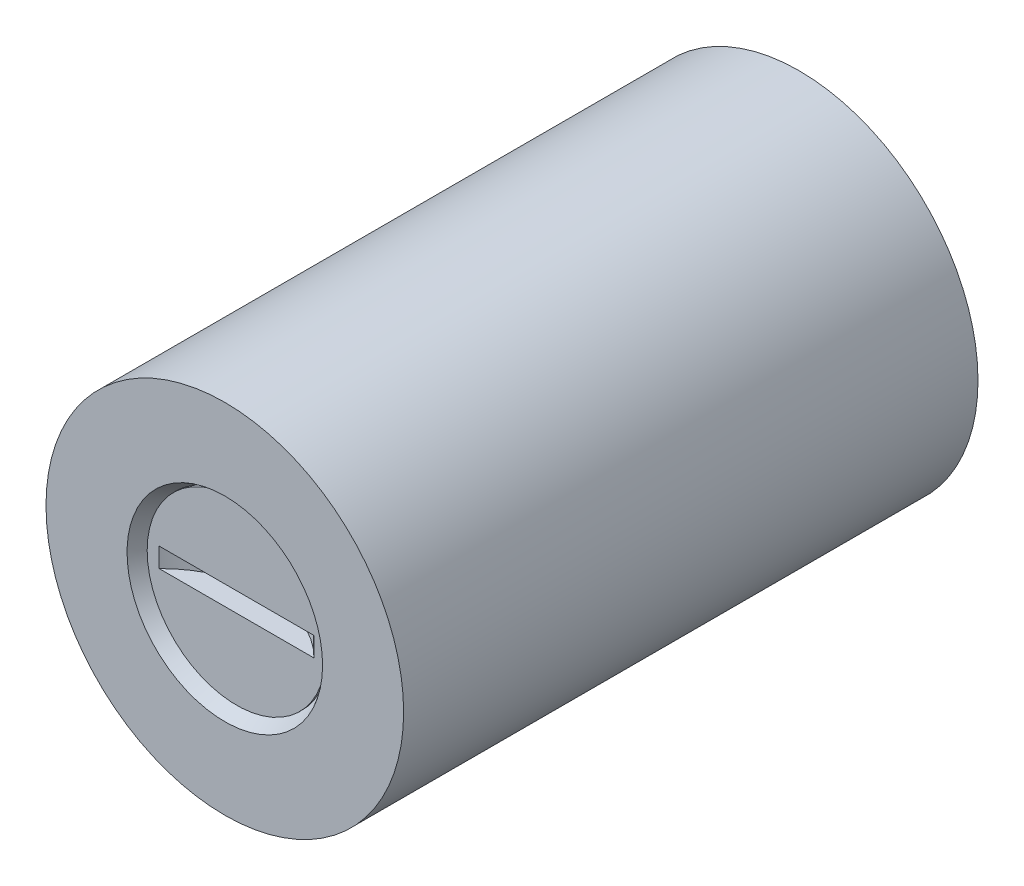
ISO-10303-21;
HEADER;
FILE_DESCRIPTION(('STEP AP214'),'2;1');
FILE_NAME('part.step','',(''),(''),'','','');
FILE_SCHEMA(('AUTOMOTIVE_DESIGN { 1 0 10303 214 1 1 1 1 }'));
ENDSEC;
DATA;
#1=APPLICATION_CONTEXT('core data for automotive mechanical design processes');
#2=APPLICATION_PROTOCOL_DEFINITION('international standard','automotive_design',2000,#1);
#3=PRODUCT_CONTEXT('',#1,'mechanical');
#4=PRODUCT('Part','Part','',(#3));
#5=PRODUCT_RELATED_PRODUCT_CATEGORY('part','',(#4));
#6=PRODUCT_DEFINITION_FORMATION('','',#4);
#7=PRODUCT_DEFINITION_CONTEXT('part definition',#1,'design');
#8=PRODUCT_DEFINITION('design','',#6,#7);
#9=PRODUCT_DEFINITION_SHAPE('','',#8);
#10=(LENGTH_UNIT() NAMED_UNIT(*) SI_UNIT(.MILLI.,.METRE.));
#11=(NAMED_UNIT(*) PLANE_ANGLE_UNIT() SI_UNIT($,.RADIAN.));
#12=(NAMED_UNIT(*) SI_UNIT($,.STERADIAN.) SOLID_ANGLE_UNIT());
#13=UNCERTAINTY_MEASURE_WITH_UNIT(LENGTH_MEASURE(1.E-05),#10,'distance_accuracy_value','');
#14=(GEOMETRIC_REPRESENTATION_CONTEXT(3) GLOBAL_UNCERTAINTY_ASSIGNED_CONTEXT((#13)) GLOBAL_UNIT_ASSIGNED_CONTEXT((#10,
#11,#12)) REPRESENTATION_CONTEXT('',''));
#15=CARTESIAN_POINT('',(0.,0.,0.));
#16=DIRECTION('',(0.,0.,1.));
#17=DIRECTION('',(1.,0.,0.));
#18=AXIS2_PLACEMENT_3D('',#15,#16,#17);
#19=CARTESIAN_POINT('',(-15.5,0.,82.));
#20=DIRECTION('',(0.,0.,1.));
#21=DIRECTION('',(0.,-1.,0.));
#22=AXIS2_PLACEMENT_3D('',#19,#20,#21);
#23=CONICAL_SURFACE('',#22,9.02072594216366,0.523598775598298);
#24=CARTESIAN_POINT('',(-15.5,0.,82.));
#25=DIRECTION('',(0.,0.,-1.));
#26=DIRECTION('',(0.,1.,0.));
#27=AXIS2_PLACEMENT_3D('',#24,#25,#26);
#28=CIRCLE('',#27,9.02072594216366);
#29=CARTESIAN_POINT('',(-15.5,9.02072594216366,82.));
#30=VERTEX_POINT('',#29);
#31=EDGE_CURVE('E61',#30,#30,#28,.T.);
#32=ORIENTED_EDGE('',*,*,#31,.F.);
#33=EDGE_LOOP('',(#32));
#34=FACE_BOUND('',#33,.T.);
#35=CARTESIAN_POINT('',(-15.5,0.,80.6650635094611));
#36=DIRECTION('',(0.,0.,1.));
#37=DIRECTION('',(1.,0.,0.));
#38=AXIS2_PLACEMENT_3D('',#35,#36,#37);
#39=CIRCLE('',#38,8.25);
#40=CARTESIAN_POINT('',(-7.25,0.,80.6650635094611));
#41=VERTEX_POINT('',#40);
#42=EDGE_CURVE('E9',#41,#41,#39,.T.);
#43=ORIENTED_EDGE('',*,*,#42,.F.);
#44=EDGE_LOOP('',(#43));
#45=FACE_BOUND('',#44,.T.);
#46=ADVANCED_FACE('F14',(#34,#45),#23,.F.);
#47=CARTESIAN_POINT('',(-15.5,0.,82.));
#48=DIRECTION('',(0.,0.,-1.));
#49=DIRECTION('',(0.,1.,0.));
#50=AXIS2_PLACEMENT_3D('',#47,#48,#49);
#51=CYLINDRICAL_SURFACE('',#50,16.5);
#52=CARTESIAN_POINT('',(-15.5,0.,82.));
#53=DIRECTION('',(0.,0.,1.));
#54=DIRECTION('',(0.,-1.,0.));
#55=AXIS2_PLACEMENT_3D('',#52,#53,#54);
#56=CIRCLE('',#55,16.5);
#57=CARTESIAN_POINT('',(-15.5,-16.5,82.));
#58=VERTEX_POINT('',#57);
#59=EDGE_CURVE('E53',#58,#58,#56,.T.);
#60=ORIENTED_EDGE('',*,*,#59,.F.);
#61=EDGE_LOOP('',(#60));
#62=FACE_BOUND('',#61,.T.);
#63=CARTESIAN_POINT('',(-15.5,0.,29.));
#64=DIRECTION('',(0.,0.,1.));
#65=DIRECTION('',(0.,-1.,0.));
#66=AXIS2_PLACEMENT_3D('',#63,#64,#65);
#67=CIRCLE('',#66,16.5);
#68=CARTESIAN_POINT('',(-15.5,-16.5,29.));
#69=VERTEX_POINT('',#68);
#70=EDGE_CURVE('E18',#69,#69,#67,.T.);
#71=ORIENTED_EDGE('',*,*,#70,.T.);
#72=EDGE_LOOP('',(#71));
#73=FACE_BOUND('',#72,.T.);
#74=ADVANCED_FACE('F16',(#62,#73),#51,.T.);
#75=CARTESIAN_POINT('',(-15.5,0.,82.));
#76=DIRECTION('',(0.,0.,1.));
#77=DIRECTION('',(0.,-1.,0.));
#78=AXIS2_PLACEMENT_3D('',#75,#76,#77);
#79=PLANE('',#78);
#80=ORIENTED_EDGE('',*,*,#31,.T.);
#81=EDGE_LOOP('',(#80));
#82=FACE_BOUND('',#81,.T.);
#83=ORIENTED_EDGE('',*,*,#59,.T.);
#84=EDGE_LOOP('',(#83));
#85=FACE_BOUND('',#84,.T.);
#86=ADVANCED_FACE('F72',(#82,#85),#79,.T.);
#87=CARTESIAN_POINT('',(-15.5,0.,29.));
#88=DIRECTION('',(0.,0.,1.));
#89=DIRECTION('',(0.,-1.,0.));
#90=AXIS2_PLACEMENT_3D('',#87,#88,#89);
#91=PLANE('',#90);
#92=ORIENTED_EDGE('',*,*,#70,.F.);
#93=EDGE_LOOP('',(#92));
#94=FACE_BOUND('',#93,.T.);
#95=ADVANCED_FACE('F70',(#94),#91,.F.);
#96=CARTESIAN_POINT('',(-15.5,0.9,87.9150635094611));
#97=DIRECTION('',(0.,1.,0.));
#98=DIRECTION('',(1.,0.,0.));
#99=AXIS2_PLACEMENT_3D('',#96,#97,#98);
#100=PLANE('',#99);
#101=CARTESIAN_POINT('',(-15.5,0.9,87.9150635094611));
#102=DIRECTION('',(0.,1.,0.));
#103=DIRECTION('',(1.,0.,0.));
#104=AXIS2_PLACEMENT_3D('',#101,#102,#103);
#105=CIRCLE('',#104,10.);
#106=CARTESIAN_POINT('',(-8.35857157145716,0.9,80.9150635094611));
#107=VERTEX_POINT('',#106);
#108=CARTESIAN_POINT('',(-22.6414284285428,0.9,80.9150635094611));
#109=VERTEX_POINT('',#108);
#110=EDGE_CURVE('E30',#107,#109,#105,.T.);
#111=ORIENTED_EDGE('',*,*,#110,.F.);
#112=DIRECTION('',(1.,0.,0.));
#113=VECTOR('',#112,1.);
#114=CARTESIAN_POINT('',(-15.5,0.9,80.9150635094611));
#115=LINE('',#114,#113);
#116=EDGE_CURVE('E44',#109,#107,#115,.T.);
#117=ORIENTED_EDGE('',*,*,#116,.F.);
#118=EDGE_LOOP('',(#111,#117));
#119=FACE_BOUND('',#118,.T.);
#120=ADVANCED_FACE('F45',(#119),#100,.F.);
#121=CARTESIAN_POINT('',(-15.5,-0.9,87.9150635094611));
#122=DIRECTION('',(0.,1.,0.));
#123=DIRECTION('',(1.,0.,0.));
#124=AXIS2_PLACEMENT_3D('',#121,#122,#123);
#125=CYLINDRICAL_SURFACE('',#124,10.);
#126=CARTESIAN_POINT('',(-15.5,-0.9,87.9150635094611));
#127=DIRECTION('',(0.,1.,0.));
#128=DIRECTION('',(1.,0.,0.));
#129=AXIS2_PLACEMENT_3D('',#126,#127,#128);
#130=CIRCLE('',#129,10.);
#131=CARTESIAN_POINT('',(-8.35857157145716,-0.9,80.9150635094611));
#132=VERTEX_POINT('',#131);
#133=CARTESIAN_POINT('',(-22.6414284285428,-0.9,80.9150635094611));
#134=VERTEX_POINT('',#133);
#135=EDGE_CURVE('E52',#132,#134,#130,.T.);
#136=ORIENTED_EDGE('',*,*,#135,.F.);
#137=DIRECTION('',(0.,1.,0.));
#138=VECTOR('',#137,1.);
#139=CARTESIAN_POINT('',(-8.35857157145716,-0.9,80.9150635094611));
#140=LINE('',#139,#138);
#141=EDGE_CURVE('E48',#107,#132,#140,.F.);
#142=ORIENTED_EDGE('',*,*,#141,.F.);
#143=ORIENTED_EDGE('',*,*,#110,.T.);
#144=DIRECTION('',(0.,1.,0.));
#145=VECTOR('',#144,1.);
#146=CARTESIAN_POINT('',(-22.6414284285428,-0.9,80.9150635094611));
#147=LINE('',#146,#145);
#148=EDGE_CURVE('E37',#134,#109,#147,.T.);
#149=ORIENTED_EDGE('',*,*,#148,.F.);
#150=EDGE_LOOP('',(#136,#142,#143,#149));
#151=FACE_BOUND('',#150,.T.);
#152=ADVANCED_FACE('F51',(#151),#125,.F.);
#153=CARTESIAN_POINT('',(-15.5,-0.9,87.9150635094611));
#154=DIRECTION('',(0.,1.,0.));
#155=DIRECTION('',(1.,0.,0.));
#156=AXIS2_PLACEMENT_3D('',#153,#154,#155);
#157=PLANE('',#156);
#158=DIRECTION('',(1.,0.,0.));
#159=VECTOR('',#158,1.);
#160=CARTESIAN_POINT('',(-15.5,-0.9,80.9150635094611));
#161=LINE('',#160,#159);
#162=EDGE_CURVE('E23',#134,#132,#161,.T.);
#163=ORIENTED_EDGE('',*,*,#162,.T.);
#164=ORIENTED_EDGE('',*,*,#135,.T.);
#165=EDGE_LOOP('',(#163,#164));
#166=FACE_BOUND('',#165,.T.);
#167=ADVANCED_FACE('F91',(#166),#157,.T.);
#168=CARTESIAN_POINT('',(-15.5,8.25,80.9150635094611));
#169=DIRECTION('',(0.,0.,-1.));
#170=DIRECTION('',(-1.,0.,0.));
#171=AXIS2_PLACEMENT_3D('',#168,#169,#170);
#172=PLANE('',#171);
#173=CARTESIAN_POINT('',(-15.5,0.,80.9150635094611));
#174=DIRECTION('',(0.,0.,1.));
#175=DIRECTION('',(1.,0.,0.));
#176=AXIS2_PLACEMENT_3D('',#173,#174,#175);
#177=CIRCLE('',#176,8.25);
#178=CARTESIAN_POINT('',(-7.25,0.,80.9150635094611));
#179=VERTEX_POINT('',#178);
#180=EDGE_CURVE('E49',#179,#179,#177,.T.);
#181=ORIENTED_EDGE('',*,*,#180,.T.);
#182=EDGE_LOOP('',(#181));
#183=FACE_BOUND('',#182,.T.);
#184=ORIENTED_EDGE('',*,*,#162,.F.);
#185=ORIENTED_EDGE('',*,*,#148,.T.);
#186=ORIENTED_EDGE('',*,*,#116,.T.);
#187=ORIENTED_EDGE('',*,*,#141,.T.);
#188=EDGE_LOOP('',(#184,#185,#186,#187));
#189=FACE_BOUND('',#188,.T.);
#190=ADVANCED_FACE('F56',(#183,#189),#172,.F.);
#191=CARTESIAN_POINT('',(-15.5,0.,80.9150635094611));
#192=DIRECTION('',(0.,0.,1.));
#193=DIRECTION('',(1.,0.,0.));
#194=AXIS2_PLACEMENT_3D('',#191,#192,#193);
#195=CYLINDRICAL_SURFACE('',#194,8.25);
#196=ORIENTED_EDGE('',*,*,#42,.T.);
#197=EDGE_LOOP('',(#196));
#198=FACE_BOUND('',#197,.T.);
#199=ORIENTED_EDGE('',*,*,#180,.F.);
#200=EDGE_LOOP('',(#199));
#201=FACE_BOUND('',#200,.T.);
#202=ADVANCED_FACE('F85',(#198,#201),#195,.T.);
#203=CLOSED_SHELL('',(#46,#74,#86,#95,#120,#152,#167,#190,#202));
#204=MANIFOLD_SOLID_BREP('B1',#203);
#205=ADVANCED_BREP_SHAPE_REPRESENTATION('',(#18,#204),#14);
#206=SHAPE_DEFINITION_REPRESENTATION(#9,#205);
ENDSEC;
END-ISO-10303-21;
